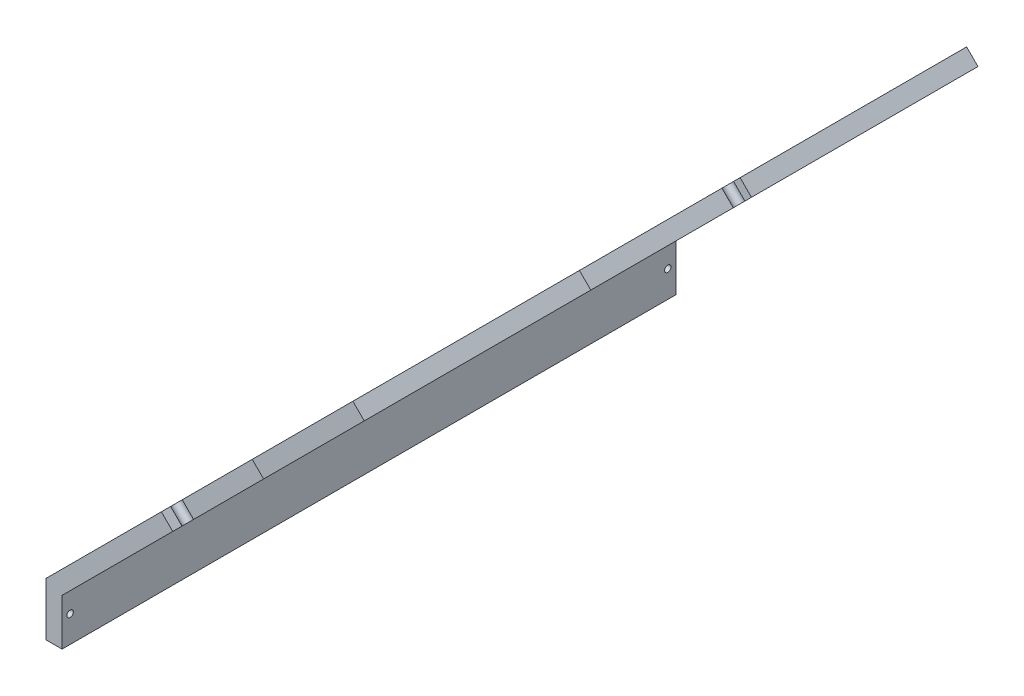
ISO-10303-21;
HEADER;
FILE_DESCRIPTION(('STEP AP214'),'2;1');
FILE_NAME('part.step','',(''),(''),'','','');
FILE_SCHEMA(('AUTOMOTIVE_DESIGN { 1 0 10303 214 1 1 1 1 }'));
ENDSEC;
DATA;
#1=APPLICATION_CONTEXT('core data for automotive mechanical design processes');
#2=APPLICATION_PROTOCOL_DEFINITION('international standard','automotive_design',2000,#1);
#3=PRODUCT_CONTEXT('',#1,'mechanical');
#4=PRODUCT('Part','Part','',(#3));
#5=PRODUCT_RELATED_PRODUCT_CATEGORY('part','',(#4));
#6=PRODUCT_DEFINITION_FORMATION('','',#4);
#7=PRODUCT_DEFINITION_CONTEXT('part definition',#1,'design');
#8=PRODUCT_DEFINITION('design','',#6,#7);
#9=PRODUCT_DEFINITION_SHAPE('','',#8);
#10=(LENGTH_UNIT() NAMED_UNIT(*) SI_UNIT(.MILLI.,.METRE.));
#11=(NAMED_UNIT(*) PLANE_ANGLE_UNIT() SI_UNIT($,.RADIAN.));
#12=(NAMED_UNIT(*) SI_UNIT($,.STERADIAN.) SOLID_ANGLE_UNIT());
#13=UNCERTAINTY_MEASURE_WITH_UNIT(LENGTH_MEASURE(1.E-05),#10,'distance_accuracy_value','');
#14=(GEOMETRIC_REPRESENTATION_CONTEXT(3) GLOBAL_UNCERTAINTY_ASSIGNED_CONTEXT((#13)) GLOBAL_UNIT_ASSIGNED_CONTEXT((#10,
#11,#12)) REPRESENTATION_CONTEXT('',''));
#15=CARTESIAN_POINT('',(0.,0.,0.));
#16=DIRECTION('',(0.,0.,1.));
#17=DIRECTION('',(1.,0.,0.));
#18=AXIS2_PLACEMENT_3D('',#15,#16,#17);
#19=CARTESIAN_POINT('',(0.,0.,191.));
#20=DIRECTION('',(0.,0.,-1.));
#21=DIRECTION('',(-1.,0.,0.));
#22=AXIS2_PLACEMENT_3D('',#19,#20,#21);
#23=PLANE('',#22);
#24=DIRECTION('',(0.707106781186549,0.707106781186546,0.));
#25=VECTOR('',#24,1.);
#26=CARTESIAN_POINT('',(94.0381308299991,108.538130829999,191.));
#27=LINE('',#26,#25);
#28=CARTESIAN_POINT('',(0.,14.5,191.));
#29=VERTEX_POINT('',#28);
#30=CARTESIAN_POINT('',(34.4314575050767,48.9314575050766,191.));
#31=VERTEX_POINT('',#30);
#32=EDGE_CURVE('E336',#29,#31,#27,.T.);
#33=ORIENTED_EDGE('',*,*,#32,.T.);
#34=DIRECTION('',(-0.707106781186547,0.707106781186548,0.));
#35=VECTOR('',#34,1.);
#36=CARTESIAN_POINT('',(34.4314575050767,48.9314575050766,191.));
#37=LINE('',#36,#35);
#38=CARTESIAN_POINT('',(30.895923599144,52.4669914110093,191.));
#39=VERTEX_POINT('',#38);
#40=EDGE_CURVE('E240',#31,#39,#37,.T.);
#41=ORIENTED_EDGE('',*,*,#40,.T.);
#42=DIRECTION('',(-0.707106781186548,-0.707106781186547,0.));
#43=VECTOR('',#42,1.);
#44=CARTESIAN_POINT('',(-5.,16.5710678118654,191.));
#45=LINE('',#44,#43);
#46=CARTESIAN_POINT('',(-5.,16.5710678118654,191.));
#47=VERTEX_POINT('',#46);
#48=EDGE_CURVE('E341',#39,#47,#45,.T.);
#49=ORIENTED_EDGE('',*,*,#48,.T.);
#50=DIRECTION('',(0.,-1.,0.));
#51=VECTOR('',#50,1.);
#52=CARTESIAN_POINT('',(-5.,0.,191.));
#53=LINE('',#52,#51);
#54=CARTESIAN_POINT('',(-5.,0.,191.));
#55=VERTEX_POINT('',#54);
#56=EDGE_CURVE('E345',#47,#55,#53,.T.);
#57=ORIENTED_EDGE('',*,*,#56,.T.);
#58=DIRECTION('',(1.,0.,0.));
#59=VECTOR('',#58,1.);
#60=CARTESIAN_POINT('',(0.,0.,191.));
#61=LINE('',#60,#59);
#62=CARTESIAN_POINT('',(0.,0.,191.));
#63=VERTEX_POINT('',#62);
#64=EDGE_CURVE('E347',#55,#63,#61,.T.);
#65=ORIENTED_EDGE('',*,*,#64,.T.);
#66=DIRECTION('',(0.,1.,0.));
#67=VECTOR('',#66,1.);
#68=CARTESIAN_POINT('',(0.,14.5,191.));
#69=LINE('',#68,#67);
#70=EDGE_CURVE('E332',#63,#29,#69,.T.);
#71=ORIENTED_EDGE('',*,*,#70,.T.);
#72=EDGE_LOOP('',(#33,#41,#49,#57,#65,#71));
#73=FACE_BOUND('',#72,.T.);
#74=ADVANCED_FACE('F33',(#73),#23,.F.);
#75=CARTESIAN_POINT('',(90.5025969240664,112.073664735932,191.));
#76=DIRECTION('',(-0.707106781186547,-0.707106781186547,0.));
#77=DIRECTION('',(0.707106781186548,-0.707106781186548,0.));
#78=AXIS2_PLACEMENT_3D('',#75,#76,#77);
#79=PLANE('',#78);
#80=DIRECTION('',(0.,0.,-1.));
#81=VECTOR('',#80,1.);
#82=CARTESIAN_POINT('',(94.0381308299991,108.538130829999,191.));
#83=LINE('',#82,#81);
#84=CARTESIAN_POINT('',(94.0381308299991,108.538130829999,191.));
#85=VERTEX_POINT('',#84);
#86=CARTESIAN_POINT('',(94.0381308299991,108.538130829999,120.5));
#87=VERTEX_POINT('',#86);
#88=EDGE_CURVE('E41',#85,#87,#83,.T.);
#89=ORIENTED_EDGE('',*,*,#88,.T.);
#90=DIRECTION('',(-0.707106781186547,0.707106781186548,0.));
#91=VECTOR('',#90,1.);
#92=CARTESIAN_POINT('',(94.0381308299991,108.538130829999,120.5));
#93=LINE('',#92,#91);
#94=CARTESIAN_POINT('',(90.5025969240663,112.073664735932,120.5));
#95=VERTEX_POINT('',#94);
#96=EDGE_CURVE('E266',#87,#95,#93,.T.);
#97=ORIENTED_EDGE('',*,*,#96,.T.);
#98=DIRECTION('',(0.,0.,-1.));
#99=VECTOR('',#98,1.);
#100=CARTESIAN_POINT('',(90.5025969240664,112.073664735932,191.));
#101=LINE('',#100,#99);
#102=CARTESIAN_POINT('',(90.5025969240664,112.073664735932,191.));
#103=VERTEX_POINT('',#102);
#104=EDGE_CURVE('E375',#103,#95,#101,.T.);
#105=ORIENTED_EDGE('',*,*,#104,.F.);
#106=DIRECTION('',(-0.707106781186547,0.707106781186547,0.));
#107=VECTOR('',#106,1.);
#108=CARTESIAN_POINT('',(90.5025969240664,112.073664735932,191.));
#109=LINE('',#108,#107);
#110=EDGE_CURVE('E339',#85,#103,#109,.T.);
#111=ORIENTED_EDGE('',*,*,#110,.F.);
#112=EDGE_LOOP('',(#89,#97,#105,#111));
#113=FACE_BOUND('',#112,.T.);
#114=ADVANCED_FACE('F415',(#113),#79,.F.);
#115=CARTESIAN_POINT('',(0.,0.,0.));
#116=DIRECTION('',(0.,0.,-1.));
#117=DIRECTION('',(-1.,0.,0.));
#118=AXIS2_PLACEMENT_3D('',#115,#116,#117);
#119=PLANE('',#118);
#120=DIRECTION('',(-0.707106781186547,0.707106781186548,0.));
#121=VECTOR('',#120,1.);
#122=CARTESIAN_POINT('',(62.7157287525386,77.2157287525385,0.));
#123=LINE('',#122,#121);
#124=CARTESIAN_POINT('',(62.7157287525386,77.2157287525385,0.));
#125=VERTEX_POINT('',#124);
#126=CARTESIAN_POINT('',(59.1801948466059,80.7512626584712,0.));
#127=VERTEX_POINT('',#126);
#128=EDGE_CURVE('E319',#125,#127,#123,.T.);
#129=ORIENTED_EDGE('',*,*,#128,.T.);
#130=DIRECTION('',(-0.707106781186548,-0.707106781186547,0.));
#131=VECTOR('',#130,1.);
#132=CARTESIAN_POINT('',(-5.,16.5710678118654,0.));
#133=LINE('',#132,#131);
#134=CARTESIAN_POINT('',(90.5025969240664,112.073664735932,0.));
#135=VERTEX_POINT('',#134);
#136=EDGE_CURVE('E360',#135,#127,#133,.T.);
#137=ORIENTED_EDGE('',*,*,#136,.F.);
#138=DIRECTION('',(-0.707106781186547,0.707106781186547,0.));
#139=VECTOR('',#138,1.);
#140=CARTESIAN_POINT('',(90.5025969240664,112.073664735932,0.));
#141=LINE('',#140,#139);
#142=CARTESIAN_POINT('',(94.0381308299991,108.538130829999,0.));
#143=VERTEX_POINT('',#142);
#144=EDGE_CURVE('E356',#143,#135,#141,.T.);
#145=ORIENTED_EDGE('',*,*,#144,.F.);
#146=DIRECTION('',(0.707106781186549,0.707106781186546,0.));
#147=VECTOR('',#146,1.);
#148=CARTESIAN_POINT('',(94.0381308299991,108.538130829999,0.));
#149=LINE('',#148,#147);
#150=EDGE_CURVE('E352',#125,#143,#149,.T.);
#151=ORIENTED_EDGE('',*,*,#150,.F.);
#152=EDGE_LOOP('',(#129,#137,#145,#151));
#153=FACE_BOUND('',#152,.T.);
#154=ADVANCED_FACE('F391',(#153),#119,.T.);
#155=CARTESIAN_POINT('',(0.,14.5,191.));
#156=DIRECTION('',(-1.,0.,0.));
#157=DIRECTION('',(0.,-1.,0.));
#158=AXIS2_PLACEMENT_3D('',#155,#156,#157);
#159=PLANE('',#158);
#160=CARTESIAN_POINT('',(0.,8.28553390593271,188.5));
#161=DIRECTION('',(-1.,0.,0.));
#162=DIRECTION('',(0.,-1.,0.));
#163=AXIS2_PLACEMENT_3D('',#160,#161,#162);
#164=CIRCLE('',#163,0.999999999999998);
#165=CARTESIAN_POINT('',(0.,7.28553390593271,188.5));
#166=VERTEX_POINT('',#165);
#167=EDGE_CURVE('E556',#166,#166,#164,.T.);
#168=ORIENTED_EDGE('',*,*,#167,.T.);
#169=EDGE_LOOP('',(#168));
#170=FACE_BOUND('',#169,.T.);
#171=CARTESIAN_POINT('',(0.,8.28553390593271,2.5));
#172=DIRECTION('',(-1.,0.,0.));
#173=DIRECTION('',(0.,-1.,0.));
#174=AXIS2_PLACEMENT_3D('',#171,#172,#173);
#175=CIRCLE('',#174,1.);
#176=CARTESIAN_POINT('',(0.,7.2855339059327,2.5));
#177=VERTEX_POINT('',#176);
#178=EDGE_CURVE('E549',#177,#177,#175,.T.);
#179=ORIENTED_EDGE('',*,*,#178,.T.);
#180=EDGE_LOOP('',(#179));
#181=FACE_BOUND('',#180,.T.);
#182=DIRECTION('',(0.,1.,0.));
#183=VECTOR('',#182,1.);
#184=CARTESIAN_POINT('',(0.,14.5,0.));
#185=LINE('',#184,#183);
#186=CARTESIAN_POINT('',(0.,0.,0.));
#187=VERTEX_POINT('',#186);
#188=CARTESIAN_POINT('',(0.,14.5,0.));
#189=VERTEX_POINT('',#188);
#190=EDGE_CURVE('E322',#187,#189,#185,.T.);
#191=ORIENTED_EDGE('',*,*,#190,.T.);
#192=DIRECTION('',(0.,0.,-1.));
#193=VECTOR('',#192,1.);
#194=CARTESIAN_POINT('',(0.,14.5,191.));
#195=LINE('',#194,#193);
#196=EDGE_CURVE('E11',#29,#189,#195,.T.);
#197=ORIENTED_EDGE('',*,*,#196,.F.);
#198=ORIENTED_EDGE('',*,*,#70,.F.);
#199=DIRECTION('',(0.,0.,-1.));
#200=VECTOR('',#199,1.);
#201=CARTESIAN_POINT('',(0.,0.,191.));
#202=LINE('',#201,#200);
#203=EDGE_CURVE('E349',#63,#187,#202,.T.);
#204=ORIENTED_EDGE('',*,*,#203,.T.);
#205=EDGE_LOOP('',(#191,#197,#198,#204));
#206=FACE_BOUND('',#205,.T.);
#207=ADVANCED_FACE('F35',(#170,#181,#206),#159,.F.);
#208=CARTESIAN_POINT('',(94.0381308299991,108.538130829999,191.));
#209=DIRECTION('',(-0.707106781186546,0.707106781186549,0.));
#210=DIRECTION('',(-0.707106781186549,-0.707106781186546,0.));
#211=AXIS2_PLACEMENT_3D('',#208,#209,#210);
#212=PLANE('',#211);
#213=CARTESIAN_POINT('',(16.4834957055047,30.9834957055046,2.50000000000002));
#214=DIRECTION('',(-0.707106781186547,0.707106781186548,0.));
#215=DIRECTION('',(-0.707106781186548,-0.707106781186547,0.));
#216=AXIS2_PLACEMENT_3D('',#213,#214,#215);
#217=CIRCLE('',#216,1.);
#218=CARTESIAN_POINT('',(15.7763889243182,30.2763889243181,2.50000000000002));
#219=VERTEX_POINT('',#218);
#220=EDGE_CURVE('E508',#219,#219,#217,.T.);
#221=ORIENTED_EDGE('',*,*,#220,.T.);
#222=EDGE_LOOP('',(#221));
#223=FACE_BOUND('',#222,.T.);
#224=CARTESIAN_POINT('',(16.4834957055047,30.9834957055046,188.5));
#225=DIRECTION('',(-0.707106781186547,0.707106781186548,0.));
#226=DIRECTION('',(-0.707106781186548,-0.707106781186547,0.));
#227=AXIS2_PLACEMENT_3D('',#224,#225,#226);
#228=CIRCLE('',#227,0.999999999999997);
#229=CARTESIAN_POINT('',(15.7763889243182,30.2763889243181,188.5));
#230=VERTEX_POINT('',#229);
#231=EDGE_CURVE('E512',#230,#230,#228,.T.);
#232=ORIENTED_EDGE('',*,*,#231,.T.);
#233=EDGE_LOOP('',(#232));
#234=FACE_BOUND('',#233,.T.);
#235=CARTESIAN_POINT('',(78.3769297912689,92.8769297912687,188.5));
#236=DIRECTION('',(-0.707106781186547,0.707106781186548,0.));
#237=DIRECTION('',(-0.707106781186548,-0.707106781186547,0.));
#238=AXIS2_PLACEMENT_3D('',#235,#236,#237);
#239=CIRCLE('',#238,0.999999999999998);
#240=CARTESIAN_POINT('',(77.6698230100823,92.1698230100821,188.5));
#241=VERTEX_POINT('',#240);
#242=EDGE_CURVE('E516',#241,#241,#239,.T.);
#243=ORIENTED_EDGE('',*,*,#242,.T.);
#244=EDGE_LOOP('',(#243));
#245=FACE_BOUND('',#244,.T.);
#246=CARTESIAN_POINT('',(92.2690654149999,106.769065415,155.75));
#247=DIRECTION('',(-0.707106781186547,0.707106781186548,0.));
#248=DIRECTION('',(-0.707106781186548,-0.707106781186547,0.));
#249=AXIS2_PLACEMENT_3D('',#246,#247,#248);
#250=CIRCLE('',#249,0.999999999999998);
#251=CARTESIAN_POINT('',(91.5619586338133,106.061958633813,155.75));
#252=VERTEX_POINT('',#251);
#253=EDGE_CURVE('E520',#252,#252,#250,.T.);
#254=ORIENTED_EDGE('',*,*,#253,.T.);
#255=EDGE_LOOP('',(#254));
#256=FACE_BOUND('',#255,.T.);
#257=CARTESIAN_POINT('',(78.3769297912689,92.8769297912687,2.49999999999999));
#258=DIRECTION('',(-0.707106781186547,0.707106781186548,0.));
#259=DIRECTION('',(-0.707106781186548,-0.707106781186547,0.));
#260=AXIS2_PLACEMENT_3D('',#257,#258,#259);
#261=CIRCLE('',#260,1.);
#262=CARTESIAN_POINT('',(77.6698230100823,92.1698230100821,2.49999999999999));
#263=VERTEX_POINT('',#262);
#264=EDGE_CURVE('E524',#263,#263,#261,.T.);
#265=ORIENTED_EDGE('',*,*,#264,.T.);
#266=EDGE_LOOP('',(#265));
#267=FACE_BOUND('',#266,.T.);
#268=CARTESIAN_POINT('',(92.173445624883,106.673445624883,35.1196842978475));
#269=DIRECTION('',(-0.707106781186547,0.707106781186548,0.));
#270=DIRECTION('',(-0.707106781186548,-0.707106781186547,0.));
#271=AXIS2_PLACEMENT_3D('',#268,#269,#270);
#272=CIRCLE('',#271,1.);
#273=CARTESIAN_POINT('',(91.4663388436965,105.966338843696,35.1196842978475));
#274=VERTEX_POINT('',#273);
#275=EDGE_CURVE('E233',#274,#274,#272,.T.);
#276=ORIENTED_EDGE('',*,*,#275,.T.);
#277=EDGE_LOOP('',(#276));
#278=FACE_BOUND('',#277,.T.);
#279=CARTESIAN_POINT('',(35.1814575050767,49.6814575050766,187.06066017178));
#280=DIRECTION('',(-0.707106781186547,0.707106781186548,0.));
#281=DIRECTION('',(-0.707106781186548,-0.707106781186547,0.));
#282=AXIS2_PLACEMENT_3D('',#279,#280,#281);
#283=CIRCLE('',#282,1.49999999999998);
#284=CARTESIAN_POINT('',(35.9314575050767,50.4314575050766,186.));
#285=VERTEX_POINT('',#284);
#286=CARTESIAN_POINT('',(34.4314575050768,48.9314575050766,188.12132034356));
#287=VERTEX_POINT('',#286);
#288=EDGE_CURVE('E226',#285,#287,#283,.T.);
#289=ORIENTED_EDGE('',*,*,#288,.T.);
#290=DIRECTION('',(0.,0.,1.));
#291=VECTOR('',#290,1.);
#292=CARTESIAN_POINT('',(34.4314575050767,48.9314575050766,191.));
#293=LINE('',#292,#291);
#294=EDGE_CURVE('E228',#287,#31,#293,.T.);
#295=ORIENTED_EDGE('',*,*,#294,.T.);
#296=ORIENTED_EDGE('',*,*,#32,.F.);
#297=ORIENTED_EDGE('',*,*,#196,.T.);
#298=CARTESIAN_POINT('',(34.4314575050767,48.9314575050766,0.));
#299=VERTEX_POINT('',#298);
#300=EDGE_CURVE('E353',#189,#299,#149,.T.);
#301=ORIENTED_EDGE('',*,*,#300,.T.);
#302=DIRECTION('',(0.,0.,1.));
#303=VECTOR('',#302,1.);
#304=CARTESIAN_POINT('',(34.4314575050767,48.9314575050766,2.87867965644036));
#305=LINE('',#304,#303);
#306=CARTESIAN_POINT('',(34.4314575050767,48.9314575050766,2.87867965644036));
#307=VERTEX_POINT('',#306);
#308=EDGE_CURVE('E290',#299,#307,#305,.T.);
#309=ORIENTED_EDGE('',*,*,#308,.T.);
#310=CARTESIAN_POINT('',(35.1814575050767,49.6814575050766,3.93933982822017));
#311=DIRECTION('',(-0.707106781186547,0.707106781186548,0.));
#312=DIRECTION('',(-0.707106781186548,-0.707106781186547,0.));
#313=AXIS2_PLACEMENT_3D('',#310,#311,#312);
#314=CIRCLE('',#313,1.5);
#315=CARTESIAN_POINT('',(35.9314575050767,50.4314575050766,4.99999999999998));
#316=VERTEX_POINT('',#315);
#317=EDGE_CURVE('E293',#307,#316,#314,.T.);
#318=ORIENTED_EDGE('',*,*,#317,.T.);
#319=DIRECTION('',(0.707106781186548,0.707106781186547,0.));
#320=VECTOR('',#319,1.);
#321=CARTESIAN_POINT('',(61.2157287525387,75.7157287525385,5.00000000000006));
#322=LINE('',#321,#320);
#323=CARTESIAN_POINT('',(61.2157287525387,75.7157287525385,5.00000000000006));
#324=VERTEX_POINT('',#323);
#325=EDGE_CURVE('E297',#316,#324,#322,.T.);
#326=ORIENTED_EDGE('',*,*,#325,.T.);
#327=CARTESIAN_POINT('',(61.9657287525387,76.4657287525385,3.93933982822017));
#328=DIRECTION('',(-0.707106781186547,0.707106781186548,0.));
#329=DIRECTION('',(-0.707106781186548,-0.707106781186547,0.));
#330=AXIS2_PLACEMENT_3D('',#327,#328,#329);
#331=CIRCLE('',#330,1.49999999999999);
#332=CARTESIAN_POINT('',(62.7157287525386,77.2157287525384,2.87867965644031));
#333=VERTEX_POINT('',#332);
#334=EDGE_CURVE('E300',#324,#333,#331,.T.);
#335=ORIENTED_EDGE('',*,*,#334,.T.);
#336=DIRECTION('',(0.,0.,-1.));
#337=VECTOR('',#336,1.);
#338=CARTESIAN_POINT('',(62.7157287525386,77.2157287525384,2.87867965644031));
#339=LINE('',#338,#337);
#340=EDGE_CURVE('E303',#333,#125,#339,.T.);
#341=ORIENTED_EDGE('',*,*,#340,.T.);
#342=ORIENTED_EDGE('',*,*,#150,.T.);
#343=CARTESIAN_POINT('',(94.0381308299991,108.538130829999,70.5));
#344=VERTEX_POINT('',#343);
#345=EDGE_CURVE('E377',#344,#143,#83,.T.);
#346=ORIENTED_EDGE('',*,*,#345,.F.);
#347=DIRECTION('',(-0.70710678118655,-0.707106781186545,0.));
#348=VECTOR('',#347,1.);
#349=CARTESIAN_POINT('',(92.0000000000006,106.5,70.5));
#350=LINE('',#349,#348);
#351=CARTESIAN_POINT('',(92.0000000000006,106.5,70.5));
#352=VERTEX_POINT('',#351);
#353=EDGE_CURVE('E253',#344,#352,#350,.T.);
#354=ORIENTED_EDGE('',*,*,#353,.T.);
#355=CARTESIAN_POINT('',(91.2500000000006,105.75,71.5606601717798));
#356=DIRECTION('',(-0.707106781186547,0.707106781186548,0.));
#357=DIRECTION('',(-0.707106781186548,-0.707106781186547,0.));
#358=AXIS2_PLACEMENT_3D('',#355,#356,#357);
#359=CIRCLE('',#358,1.49999999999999);
#360=CARTESIAN_POINT('',(90.5000000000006,105.,72.6213203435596));
#361=VERTEX_POINT('',#360);
#362=EDGE_CURVE('E257',#352,#361,#359,.T.);
#363=ORIENTED_EDGE('',*,*,#362,.T.);
#364=DIRECTION('',(0.,0.,1.));
#365=VECTOR('',#364,1.);
#366=CARTESIAN_POINT('',(90.5000000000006,105.,72.6213203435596));
#367=LINE('',#366,#365);
#368=CARTESIAN_POINT('',(90.5000000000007,105.,118.37867965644));
#369=VERTEX_POINT('',#368);
#370=EDGE_CURVE('E260',#361,#369,#367,.T.);
#371=ORIENTED_EDGE('',*,*,#370,.T.);
#372=CARTESIAN_POINT('',(91.2500000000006,105.75,119.43933982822));
#373=DIRECTION('',(-0.707106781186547,0.707106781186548,0.));
#374=DIRECTION('',(-0.707106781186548,-0.707106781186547,0.));
#375=AXIS2_PLACEMENT_3D('',#372,#373,#374);
#376=CIRCLE('',#375,1.49999999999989);
#377=CARTESIAN_POINT('',(92.0000000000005,106.5,120.5));
#378=VERTEX_POINT('',#377);
#379=EDGE_CURVE('E263',#369,#378,#376,.T.);
#380=ORIENTED_EDGE('',*,*,#379,.T.);
#381=DIRECTION('',(0.707106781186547,0.707106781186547,0.));
#382=VECTOR('',#381,1.);
#383=CARTESIAN_POINT('',(92.0000000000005,106.5,120.5));
#384=LINE('',#383,#382);
#385=EDGE_CURVE('E250',#378,#87,#384,.T.);
#386=ORIENTED_EDGE('',*,*,#385,.T.);
#387=ORIENTED_EDGE('',*,*,#88,.F.);
#388=CARTESIAN_POINT('',(62.7157287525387,77.2157287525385,191.));
#389=VERTEX_POINT('',#388);
#390=EDGE_CURVE('E216',#389,#85,#27,.T.);
#391=ORIENTED_EDGE('',*,*,#390,.F.);
#392=DIRECTION('',(0.,0.,-1.));
#393=VECTOR('',#392,1.);
#394=CARTESIAN_POINT('',(62.7157287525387,77.2157287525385,191.));
#395=LINE('',#394,#393);
#396=CARTESIAN_POINT('',(62.7157287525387,77.2157287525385,188.12132034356));
#397=VERTEX_POINT('',#396);
#398=EDGE_CURVE('E48',#389,#397,#395,.T.);
#399=ORIENTED_EDGE('',*,*,#398,.T.);
#400=CARTESIAN_POINT('',(61.9657287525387,76.4657287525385,187.06066017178));
#401=DIRECTION('',(-0.707106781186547,0.707106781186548,0.));
#402=DIRECTION('',(-0.707106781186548,-0.707106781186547,0.));
#403=AXIS2_PLACEMENT_3D('',#400,#401,#402);
#404=CIRCLE('',#403,1.5);
#405=CARTESIAN_POINT('',(61.2157287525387,75.7157287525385,186.));
#406=VERTEX_POINT('',#405);
#407=EDGE_CURVE('E205',#397,#406,#404,.T.);
#408=ORIENTED_EDGE('',*,*,#407,.T.);
#409=DIRECTION('',(-0.707106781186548,-0.707106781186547,0.));
#410=VECTOR('',#409,1.);
#411=CARTESIAN_POINT('',(61.2157287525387,75.7157287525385,186.));
#412=LINE('',#411,#410);
#413=EDGE_CURVE('E210',#406,#285,#412,.T.);
#414=ORIENTED_EDGE('',*,*,#413,.T.);
#415=EDGE_LOOP('',(#289,#295,#296,#297,#301,#309,#318,#326,#335,#341,#342,#346,#354,#363,#371,
#380,#386,#387,#391,#399,#408,#414));
#416=FACE_BOUND('',#415,.T.);
#417=ADVANCED_FACE('F214',(#223,#234,#245,#256,#267,#278,#416),#212,.F.);
#418=CARTESIAN_POINT('',(90.5025969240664,112.073664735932,70.5));
#419=VERTEX_POINT('',#418);
#420=EDGE_CURVE('E374',#419,#135,#101,.T.);
#421=ORIENTED_EDGE('',*,*,#420,.F.);
#422=DIRECTION('',(-0.707106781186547,0.707106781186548,0.));
#423=VECTOR('',#422,1.);
#424=CARTESIAN_POINT('',(94.0381308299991,108.538130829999,70.5));
#425=LINE('',#424,#423);
#426=EDGE_CURVE('E56',#344,#419,#425,.T.);
#427=ORIENTED_EDGE('',*,*,#426,.F.);
#428=ORIENTED_EDGE('',*,*,#345,.T.);
#429=ORIENTED_EDGE('',*,*,#144,.T.);
#430=EDGE_LOOP('',(#421,#427,#428,#429));
#431=FACE_BOUND('',#430,.T.);
#432=ADVANCED_FACE('F385',(#431),#79,.F.);
#433=CARTESIAN_POINT('',(-5.,16.5710678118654,191.));
#434=DIRECTION('',(0.707106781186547,-0.707106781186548,0.));
#435=DIRECTION('',(0.707106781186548,0.707106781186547,0.));
#436=AXIS2_PLACEMENT_3D('',#433,#434,#435);
#437=PLANE('',#436);
#438=CARTESIAN_POINT('',(12.947961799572,34.5190296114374,2.50000000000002));
#439=DIRECTION('',(-0.707106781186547,0.707106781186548,0.));
#440=DIRECTION('',(-0.707106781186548,-0.707106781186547,0.));
#441=AXIS2_PLACEMENT_3D('',#438,#439,#440);
#442=CIRCLE('',#441,1.);
#443=CARTESIAN_POINT('',(12.2408550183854,33.8119228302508,2.50000000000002));
#444=VERTEX_POINT('',#443);
#445=EDGE_CURVE('E546',#444,#444,#442,.T.);
#446=ORIENTED_EDGE('',*,*,#445,.F.);
#447=EDGE_LOOP('',(#446));
#448=FACE_BOUND('',#447,.T.);
#449=CARTESIAN_POINT('',(12.947961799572,34.5190296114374,188.5));
#450=DIRECTION('',(-0.707106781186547,0.707106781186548,0.));
#451=DIRECTION('',(-0.707106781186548,-0.707106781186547,0.));
#452=AXIS2_PLACEMENT_3D('',#449,#450,#451);
#453=CIRCLE('',#452,0.999999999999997);
#454=CARTESIAN_POINT('',(12.2408550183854,33.8119228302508,188.5));
#455=VERTEX_POINT('',#454);
#456=EDGE_CURVE('E542',#455,#455,#453,.T.);
#457=ORIENTED_EDGE('',*,*,#456,.F.);
#458=EDGE_LOOP('',(#457));
#459=FACE_BOUND('',#458,.T.);
#460=CARTESIAN_POINT('',(74.8413958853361,96.4124636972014,188.5));
#461=DIRECTION('',(-0.707106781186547,0.707106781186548,0.));
#462=DIRECTION('',(-0.707106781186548,-0.707106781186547,0.));
#463=AXIS2_PLACEMENT_3D('',#460,#461,#462);
#464=CIRCLE('',#463,0.999999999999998);
#465=CARTESIAN_POINT('',(74.1342891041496,95.7053569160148,188.5));
#466=VERTEX_POINT('',#465);
#467=EDGE_CURVE('E538',#466,#466,#464,.T.);
#468=ORIENTED_EDGE('',*,*,#467,.F.);
#469=EDGE_LOOP('',(#468));
#470=FACE_BOUND('',#469,.T.);
#471=CARTESIAN_POINT('',(88.7335315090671,110.304599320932,155.75));
#472=DIRECTION('',(-0.707106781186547,0.707106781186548,0.));
#473=DIRECTION('',(-0.707106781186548,-0.707106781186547,0.));
#474=AXIS2_PLACEMENT_3D('',#471,#472,#473);
#475=CIRCLE('',#474,0.999999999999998);
#476=CARTESIAN_POINT('',(88.0264247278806,109.597492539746,155.75));
#477=VERTEX_POINT('',#476);
#478=EDGE_CURVE('E534',#477,#477,#475,.T.);
#479=ORIENTED_EDGE('',*,*,#478,.F.);
#480=EDGE_LOOP('',(#479));
#481=FACE_BOUND('',#480,.T.);
#482=CARTESIAN_POINT('',(74.8413958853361,96.4124636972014,2.49999999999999));
#483=DIRECTION('',(-0.707106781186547,0.707106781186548,0.));
#484=DIRECTION('',(-0.707106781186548,-0.707106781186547,0.));
#485=AXIS2_PLACEMENT_3D('',#482,#483,#484);
#486=CIRCLE('',#485,1.);
#487=CARTESIAN_POINT('',(74.1342891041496,95.7053569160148,2.49999999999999));
#488=VERTEX_POINT('',#487);
#489=EDGE_CURVE('E530',#488,#488,#486,.T.);
#490=ORIENTED_EDGE('',*,*,#489,.F.);
#491=EDGE_LOOP('',(#490));
#492=FACE_BOUND('',#491,.T.);
#493=CARTESIAN_POINT('',(88.6379117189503,110.208979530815,35.1196842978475));
#494=DIRECTION('',(-0.707106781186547,0.707106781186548,0.));
#495=DIRECTION('',(-0.707106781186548,-0.707106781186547,0.));
#496=AXIS2_PLACEMENT_3D('',#493,#494,#495);
#497=CIRCLE('',#496,1.);
#498=CARTESIAN_POINT('',(87.9308049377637,109.501872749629,35.1196842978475));
#499=VERTEX_POINT('',#498);
#500=EDGE_CURVE('E222',#499,#499,#497,.T.);
#501=ORIENTED_EDGE('',*,*,#500,.F.);
#502=EDGE_LOOP('',(#501));
#503=FACE_BOUND('',#502,.T.);
#504=ORIENTED_EDGE('',*,*,#48,.F.);
#505=DIRECTION('',(0.,0.,1.));
#506=VECTOR('',#505,1.);
#507=CARTESIAN_POINT('',(30.895923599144,52.4669914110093,191.));
#508=LINE('',#507,#506);
#509=CARTESIAN_POINT('',(30.895923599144,52.4669914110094,188.12132034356));
#510=VERTEX_POINT('',#509);
#511=EDGE_CURVE('E217',#510,#39,#508,.T.);
#512=ORIENTED_EDGE('',*,*,#511,.F.);
#513=CARTESIAN_POINT('',(31.645923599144,53.2169914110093,187.06066017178));
#514=DIRECTION('',(-0.707106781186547,0.707106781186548,0.));
#515=DIRECTION('',(-0.707106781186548,-0.707106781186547,0.));
#516=AXIS2_PLACEMENT_3D('',#513,#514,#515);
#517=CIRCLE('',#516,1.49999999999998);
#518=CARTESIAN_POINT('',(32.395923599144,53.9669914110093,186.));
#519=VERTEX_POINT('',#518);
#520=EDGE_CURVE('E219',#519,#510,#517,.T.);
#521=ORIENTED_EDGE('',*,*,#520,.F.);
#522=DIRECTION('',(-0.707106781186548,-0.707106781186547,0.));
#523=VECTOR('',#522,1.);
#524=CARTESIAN_POINT('',(57.6801948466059,79.2512626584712,186.));
#525=LINE('',#524,#523);
#526=CARTESIAN_POINT('',(57.6801948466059,79.2512626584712,186.));
#527=VERTEX_POINT('',#526);
#528=EDGE_CURVE('E235',#527,#519,#525,.T.);
#529=ORIENTED_EDGE('',*,*,#528,.F.);
#530=CARTESIAN_POINT('',(58.4301948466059,80.0012626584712,187.06066017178));
#531=DIRECTION('',(-0.707106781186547,0.707106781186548,0.));
#532=DIRECTION('',(-0.707106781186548,-0.707106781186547,0.));
#533=AXIS2_PLACEMENT_3D('',#530,#531,#532);
#534=CIRCLE('',#533,1.5);
#535=CARTESIAN_POINT('',(59.1801948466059,80.7512626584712,188.12132034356));
#536=VERTEX_POINT('',#535);
#537=EDGE_CURVE('E232',#536,#527,#534,.T.);
#538=ORIENTED_EDGE('',*,*,#537,.F.);
#539=DIRECTION('',(0.,0.,-1.));
#540=VECTOR('',#539,1.);
#541=CARTESIAN_POINT('',(59.1801948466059,80.7512626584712,191.));
#542=LINE('',#541,#540);
#543=CARTESIAN_POINT('',(59.1801948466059,80.7512626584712,191.));
#544=VERTEX_POINT('',#543);
#545=EDGE_CURVE('E197',#544,#536,#542,.T.);
#546=ORIENTED_EDGE('',*,*,#545,.F.);
#547=EDGE_CURVE('E342',#103,#544,#45,.T.);
#548=ORIENTED_EDGE('',*,*,#547,.F.);
#549=ORIENTED_EDGE('',*,*,#104,.T.);
#550=DIRECTION('',(0.707106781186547,0.707106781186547,0.));
#551=VECTOR('',#550,1.);
#552=CARTESIAN_POINT('',(88.4644660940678,110.035533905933,120.5));
#553=LINE('',#552,#551);
#554=CARTESIAN_POINT('',(88.4644660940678,110.035533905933,120.5));
#555=VERTEX_POINT('',#554);
#556=EDGE_CURVE('E243',#555,#95,#553,.T.);
#557=ORIENTED_EDGE('',*,*,#556,.F.);
#558=CARTESIAN_POINT('',(87.7144660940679,109.285533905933,119.43933982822));
#559=DIRECTION('',(-0.707106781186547,0.707106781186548,0.));
#560=DIRECTION('',(-0.707106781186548,-0.707106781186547,0.));
#561=AXIS2_PLACEMENT_3D('',#558,#559,#560);
#562=CIRCLE('',#561,1.49999999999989);
#563=CARTESIAN_POINT('',(86.9644660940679,108.535533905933,118.37867965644));
#564=VERTEX_POINT('',#563);
#565=EDGE_CURVE('E254',#564,#555,#562,.T.);
#566=ORIENTED_EDGE('',*,*,#565,.F.);
#567=DIRECTION('',(0.,0.,1.));
#568=VECTOR('',#567,1.);
#569=CARTESIAN_POINT('',(86.9644660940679,108.535533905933,72.6213203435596));
#570=LINE('',#569,#568);
#571=CARTESIAN_POINT('',(86.9644660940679,108.535533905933,72.6213203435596));
#572=VERTEX_POINT('',#571);
#573=EDGE_CURVE('E273',#572,#564,#570,.T.);
#574=ORIENTED_EDGE('',*,*,#573,.F.);
#575=CARTESIAN_POINT('',(87.7144660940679,109.285533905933,71.5606601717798));
#576=DIRECTION('',(-0.707106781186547,0.707106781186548,0.));
#577=DIRECTION('',(-0.707106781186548,-0.707106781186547,0.));
#578=AXIS2_PLACEMENT_3D('',#575,#576,#577);
#579=CIRCLE('',#578,1.49999999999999);
#580=CARTESIAN_POINT('',(88.4644660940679,110.035533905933,70.5));
#581=VERTEX_POINT('',#580);
#582=EDGE_CURVE('E270',#581,#572,#579,.T.);
#583=ORIENTED_EDGE('',*,*,#582,.F.);
#584=DIRECTION('',(-0.70710678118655,-0.707106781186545,0.));
#585=VECTOR('',#584,1.);
#586=CARTESIAN_POINT('',(88.4644660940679,110.035533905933,70.5));
#587=LINE('',#586,#585);
#588=EDGE_CURVE('E268',#419,#581,#587,.T.);
#589=ORIENTED_EDGE('',*,*,#588,.F.);
#590=ORIENTED_EDGE('',*,*,#420,.T.);
#591=ORIENTED_EDGE('',*,*,#136,.T.);
#592=DIRECTION('',(0.,0.,-1.));
#593=VECTOR('',#592,1.);
#594=CARTESIAN_POINT('',(59.1801948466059,80.7512626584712,2.87867965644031));
#595=LINE('',#594,#593);
#596=CARTESIAN_POINT('',(59.1801948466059,80.7512626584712,2.87867965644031));
#597=VERTEX_POINT('',#596);
#598=EDGE_CURVE('E294',#597,#127,#595,.T.);
#599=ORIENTED_EDGE('',*,*,#598,.F.);
#600=CARTESIAN_POINT('',(58.4301948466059,80.0012626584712,3.93933982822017));
#601=DIRECTION('',(-0.707106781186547,0.707106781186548,0.));
#602=DIRECTION('',(-0.707106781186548,-0.707106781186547,0.));
#603=AXIS2_PLACEMENT_3D('',#600,#601,#602);
#604=CIRCLE('',#603,1.49999999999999);
#605=CARTESIAN_POINT('',(57.680194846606,79.2512626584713,5.00000000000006));
#606=VERTEX_POINT('',#605);
#607=EDGE_CURVE('E315',#606,#597,#604,.T.);
#608=ORIENTED_EDGE('',*,*,#607,.F.);
#609=DIRECTION('',(0.707106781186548,0.707106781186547,0.));
#610=VECTOR('',#609,1.);
#611=CARTESIAN_POINT('',(57.680194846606,79.2512626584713,5.00000000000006));
#612=LINE('',#611,#610);
#613=CARTESIAN_POINT('',(32.395923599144,53.9669914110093,4.99999999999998));
#614=VERTEX_POINT('',#613);
#615=EDGE_CURVE('E312',#614,#606,#612,.T.);
#616=ORIENTED_EDGE('',*,*,#615,.F.);
#617=CARTESIAN_POINT('',(31.645923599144,53.2169914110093,3.93933982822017));
#618=DIRECTION('',(-0.707106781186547,0.707106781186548,0.));
#619=DIRECTION('',(-0.707106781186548,-0.707106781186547,0.));
#620=AXIS2_PLACEMENT_3D('',#617,#618,#619);
#621=CIRCLE('',#620,1.5);
#622=CARTESIAN_POINT('',(30.895923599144,52.4669914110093,2.87867965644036));
#623=VERTEX_POINT('',#622);
#624=EDGE_CURVE('E309',#623,#614,#621,.T.);
#625=ORIENTED_EDGE('',*,*,#624,.F.);
#626=DIRECTION('',(0.,0.,1.));
#627=VECTOR('',#626,1.);
#628=CARTESIAN_POINT('',(30.895923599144,52.4669914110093,2.87867965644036));
#629=LINE('',#628,#627);
#630=CARTESIAN_POINT('',(30.895923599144,52.4669914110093,0.));
#631=VERTEX_POINT('',#630);
#632=EDGE_CURVE('E280',#631,#623,#629,.T.);
#633=ORIENTED_EDGE('',*,*,#632,.F.);
#634=CARTESIAN_POINT('',(-5.,16.5710678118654,0.));
#635=VERTEX_POINT('',#634);
#636=EDGE_CURVE('E359',#631,#635,#133,.T.);
#637=ORIENTED_EDGE('',*,*,#636,.T.);
#638=DIRECTION('',(0.,0.,-1.));
#639=VECTOR('',#638,1.);
#640=CARTESIAN_POINT('',(-5.,16.5710678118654,191.));
#641=LINE('',#640,#639);
#642=EDGE_CURVE('E371',#47,#635,#641,.T.);
#643=ORIENTED_EDGE('',*,*,#642,.F.);
#644=EDGE_LOOP('',(#504,#512,#521,#529,#538,#546,#548,#549,#557,#566,#574,#583,#589,#590,#591,
#599,#608,#616,#625,#633,#637,#643));
#645=FACE_BOUND('',#644,.T.);
#646=ADVANCED_FACE('F395',(#448,#459,#470,#481,#492,#503,#645),#437,.F.);
#647=CARTESIAN_POINT('',(-5.,0.,191.));
#648=DIRECTION('',(1.,0.,0.));
#649=DIRECTION('',(0.,1.,0.));
#650=AXIS2_PLACEMENT_3D('',#647,#648,#649);
#651=PLANE('',#650);
#652=CARTESIAN_POINT('',(-5.,8.28553390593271,188.5));
#653=DIRECTION('',(-1.,0.,0.));
#654=DIRECTION('',(0.,-1.,0.));
#655=AXIS2_PLACEMENT_3D('',#652,#653,#654);
#656=CIRCLE('',#655,0.999999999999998);
#657=CARTESIAN_POINT('',(-5.,7.28553390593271,188.5));
#658=VERTEX_POINT('',#657);
#659=EDGE_CURVE('E559',#658,#658,#656,.T.);
#660=ORIENTED_EDGE('',*,*,#659,.F.);
#661=EDGE_LOOP('',(#660));
#662=FACE_BOUND('',#661,.T.);
#663=CARTESIAN_POINT('',(-5.,8.28553390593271,2.5));
#664=DIRECTION('',(-1.,0.,0.));
#665=DIRECTION('',(0.,-1.,0.));
#666=AXIS2_PLACEMENT_3D('',#663,#664,#665);
#667=CIRCLE('',#666,1.);
#668=CARTESIAN_POINT('',(-5.,7.2855339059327,2.5));
#669=VERTEX_POINT('',#668);
#670=EDGE_CURVE('E553',#669,#669,#667,.T.);
#671=ORIENTED_EDGE('',*,*,#670,.F.);
#672=EDGE_LOOP('',(#671));
#673=FACE_BOUND('',#672,.T.);
#674=DIRECTION('',(0.,-1.,0.));
#675=VECTOR('',#674,1.);
#676=CARTESIAN_POINT('',(-5.,0.,0.));
#677=LINE('',#676,#675);
#678=CARTESIAN_POINT('',(-5.,0.,0.));
#679=VERTEX_POINT('',#678);
#680=EDGE_CURVE('E363',#635,#679,#677,.T.);
#681=ORIENTED_EDGE('',*,*,#680,.T.);
#682=DIRECTION('',(0.,0.,-1.));
#683=VECTOR('',#682,1.);
#684=CARTESIAN_POINT('',(-5.,0.,191.));
#685=LINE('',#684,#683);
#686=EDGE_CURVE('E368',#55,#679,#685,.T.);
#687=ORIENTED_EDGE('',*,*,#686,.F.);
#688=ORIENTED_EDGE('',*,*,#56,.F.);
#689=ORIENTED_EDGE('',*,*,#642,.T.);
#690=EDGE_LOOP('',(#681,#687,#688,#689));
#691=FACE_BOUND('',#690,.T.);
#692=ADVANCED_FACE('F438',(#662,#673,#691),#651,.F.);
#693=CARTESIAN_POINT('',(0.,0.,191.));
#694=DIRECTION('',(0.,1.,0.));
#695=DIRECTION('',(-1.,0.,0.));
#696=AXIS2_PLACEMENT_3D('',#693,#694,#695);
#697=PLANE('',#696);
#698=DIRECTION('',(1.,0.,0.));
#699=VECTOR('',#698,1.);
#700=CARTESIAN_POINT('',(0.,0.,0.));
#701=LINE('',#700,#699);
#702=EDGE_CURVE('E335',#679,#187,#701,.T.);
#703=ORIENTED_EDGE('',*,*,#702,.T.);
#704=ORIENTED_EDGE('',*,*,#203,.F.);
#705=ORIENTED_EDGE('',*,*,#64,.F.);
#706=ORIENTED_EDGE('',*,*,#686,.T.);
#707=EDGE_LOOP('',(#703,#704,#705,#706));
#708=FACE_BOUND('',#707,.T.);
#709=ADVANCED_FACE('F444',(#708),#697,.F.);
#710=ORIENTED_EDGE('',*,*,#547,.T.);
#711=DIRECTION('',(-0.707106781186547,0.707106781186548,0.));
#712=VECTOR('',#711,1.);
#713=CARTESIAN_POINT('',(62.7157287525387,77.2157287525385,191.));
#714=LINE('',#713,#712);
#715=EDGE_CURVE('E202',#389,#544,#714,.T.);
#716=ORIENTED_EDGE('',*,*,#715,.F.);
#717=ORIENTED_EDGE('',*,*,#390,.T.);
#718=ORIENTED_EDGE('',*,*,#110,.T.);
#719=EDGE_LOOP('',(#710,#716,#717,#718));
#720=FACE_BOUND('',#719,.T.);
#721=ADVANCED_FACE('F418',(#720),#23,.F.);
#722=DIRECTION('',(-0.707106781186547,0.707106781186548,0.));
#723=VECTOR('',#722,1.);
#724=CARTESIAN_POINT('',(34.4314575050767,48.9314575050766,0.));
#725=LINE('',#724,#723);
#726=EDGE_CURVE('E306',#299,#631,#725,.T.);
#727=ORIENTED_EDGE('',*,*,#726,.F.);
#728=ORIENTED_EDGE('',*,*,#300,.F.);
#729=ORIENTED_EDGE('',*,*,#190,.F.);
#730=ORIENTED_EDGE('',*,*,#702,.F.);
#731=ORIENTED_EDGE('',*,*,#680,.F.);
#732=ORIENTED_EDGE('',*,*,#636,.F.);
#733=EDGE_LOOP('',(#727,#728,#729,#730,#731,#732));
#734=FACE_BOUND('',#733,.T.);
#735=ADVANCED_FACE('F450',(#734),#119,.T.);
#736=CARTESIAN_POINT('',(62.7157287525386,77.2157287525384,2.87867965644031));
#737=DIRECTION('',(0.707106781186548,0.707106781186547,0.));
#738=DIRECTION('',(-0.707106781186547,0.707106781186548,0.));
#739=AXIS2_PLACEMENT_3D('',#736,#737,#738);
#740=PLANE('',#739);
#741=ORIENTED_EDGE('',*,*,#598,.T.);
#742=ORIENTED_EDGE('',*,*,#128,.F.);
#743=ORIENTED_EDGE('',*,*,#340,.F.);
#744=DIRECTION('',(-0.707106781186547,0.707106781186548,0.));
#745=VECTOR('',#744,1.);
#746=CARTESIAN_POINT('',(62.7157287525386,77.2157287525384,2.87867965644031));
#747=LINE('',#746,#745);
#748=EDGE_CURVE('E323',#333,#597,#747,.T.);
#749=ORIENTED_EDGE('',*,*,#748,.T.);
#750=EDGE_LOOP('',(#741,#742,#743,#749));
#751=FACE_BOUND('',#750,.T.);
#752=ADVANCED_FACE('F465',(#751),#740,.F.);
#753=CARTESIAN_POINT('',(61.9657287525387,76.4657287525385,3.93933982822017));
#754=DIRECTION('',(-0.707106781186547,0.707106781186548,0.));
#755=DIRECTION('',(-0.707106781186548,-0.707106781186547,0.));
#756=AXIS2_PLACEMENT_3D('',#753,#754,#755);
#757=CYLINDRICAL_SURFACE('',#756,1.49999999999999);
#758=ORIENTED_EDGE('',*,*,#607,.T.);
#759=ORIENTED_EDGE('',*,*,#748,.F.);
#760=ORIENTED_EDGE('',*,*,#334,.F.);
#761=DIRECTION('',(-0.707106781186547,0.707106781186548,0.));
#762=VECTOR('',#761,1.);
#763=CARTESIAN_POINT('',(61.2157287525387,75.7157287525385,5.00000000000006));
#764=LINE('',#763,#762);
#765=EDGE_CURVE('E325',#324,#606,#764,.T.);
#766=ORIENTED_EDGE('',*,*,#765,.T.);
#767=EDGE_LOOP('',(#758,#759,#760,#766));
#768=FACE_BOUND('',#767,.T.);
#769=ADVANCED_FACE('F463',(#768),#757,.F.);
#770=CARTESIAN_POINT('',(61.2157287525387,75.7157287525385,5.00000000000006));
#771=DIRECTION('',(0.,0.,1.));
#772=DIRECTION('',(1.,0.,0.));
#773=AXIS2_PLACEMENT_3D('',#770,#771,#772);
#774=PLANE('',#773);
#775=ORIENTED_EDGE('',*,*,#615,.T.);
#776=ORIENTED_EDGE('',*,*,#765,.F.);
#777=ORIENTED_EDGE('',*,*,#325,.F.);
#778=DIRECTION('',(-0.707106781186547,0.707106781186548,0.));
#779=VECTOR('',#778,1.);
#780=CARTESIAN_POINT('',(35.9314575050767,50.4314575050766,4.99999999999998));
#781=LINE('',#780,#779);
#782=EDGE_CURVE('E327',#316,#614,#781,.T.);
#783=ORIENTED_EDGE('',*,*,#782,.T.);
#784=EDGE_LOOP('',(#775,#776,#777,#783));
#785=FACE_BOUND('',#784,.T.);
#786=ADVANCED_FACE('F461',(#785),#774,.F.);
#787=CARTESIAN_POINT('',(35.1814575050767,49.6814575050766,3.93933982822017));
#788=DIRECTION('',(-0.707106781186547,0.707106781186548,0.));
#789=DIRECTION('',(-0.707106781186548,-0.707106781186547,0.));
#790=AXIS2_PLACEMENT_3D('',#787,#788,#789);
#791=CYLINDRICAL_SURFACE('',#790,1.5);
#792=ORIENTED_EDGE('',*,*,#624,.T.);
#793=ORIENTED_EDGE('',*,*,#782,.F.);
#794=ORIENTED_EDGE('',*,*,#317,.F.);
#795=DIRECTION('',(-0.707106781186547,0.707106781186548,0.));
#796=VECTOR('',#795,1.);
#797=CARTESIAN_POINT('',(34.4314575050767,48.9314575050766,2.87867965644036));
#798=LINE('',#797,#796);
#799=EDGE_CURVE('E329',#307,#623,#798,.T.);
#800=ORIENTED_EDGE('',*,*,#799,.T.);
#801=EDGE_LOOP('',(#792,#793,#794,#800));
#802=FACE_BOUND('',#801,.T.);
#803=ADVANCED_FACE('F456',(#802),#791,.F.);
#804=CARTESIAN_POINT('',(34.4314575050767,48.9314575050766,2.87867965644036));
#805=DIRECTION('',(-0.707106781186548,-0.707106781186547,0.));
#806=DIRECTION('',(0.707106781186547,-0.707106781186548,0.));
#807=AXIS2_PLACEMENT_3D('',#804,#805,#806);
#808=PLANE('',#807);
#809=ORIENTED_EDGE('',*,*,#632,.T.);
#810=ORIENTED_EDGE('',*,*,#799,.F.);
#811=ORIENTED_EDGE('',*,*,#308,.F.);
#812=ORIENTED_EDGE('',*,*,#726,.T.);
#813=EDGE_LOOP('',(#809,#810,#811,#812));
#814=FACE_BOUND('',#813,.T.);
#815=ADVANCED_FACE('F452',(#814),#808,.F.);
#816=CARTESIAN_POINT('',(92.0000000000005,106.5,120.5));
#817=DIRECTION('',(0.,0.,1.));
#818=DIRECTION('',(1.,0.,0.));
#819=AXIS2_PLACEMENT_3D('',#816,#817,#818);
#820=PLANE('',#819);
#821=ORIENTED_EDGE('',*,*,#556,.T.);
#822=ORIENTED_EDGE('',*,*,#96,.F.);
#823=ORIENTED_EDGE('',*,*,#385,.F.);
#824=DIRECTION('',(-0.707106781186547,0.707106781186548,0.));
#825=VECTOR('',#824,1.);
#826=CARTESIAN_POINT('',(92.0000000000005,106.5,120.5));
#827=LINE('',#826,#825);
#828=EDGE_CURVE('E278',#378,#555,#827,.T.);
#829=ORIENTED_EDGE('',*,*,#828,.T.);
#830=EDGE_LOOP('',(#821,#822,#823,#829));
#831=FACE_BOUND('',#830,.T.);
#832=ADVANCED_FACE('F413',(#831),#820,.F.);
#833=CARTESIAN_POINT('',(91.2500000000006,105.75,119.43933982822));
#834=DIRECTION('',(-0.707106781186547,0.707106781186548,0.));
#835=DIRECTION('',(-0.707106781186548,-0.707106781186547,0.));
#836=AXIS2_PLACEMENT_3D('',#833,#834,#835);
#837=CYLINDRICAL_SURFACE('',#836,1.49999999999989);
#838=ORIENTED_EDGE('',*,*,#565,.T.);
#839=ORIENTED_EDGE('',*,*,#828,.F.);
#840=ORIENTED_EDGE('',*,*,#379,.F.);
#841=DIRECTION('',(-0.707106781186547,0.707106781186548,0.));
#842=VECTOR('',#841,1.);
#843=CARTESIAN_POINT('',(90.5000000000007,105.,118.37867965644));
#844=LINE('',#843,#842);
#845=EDGE_CURVE('E281',#369,#564,#844,.T.);
#846=ORIENTED_EDGE('',*,*,#845,.T.);
#847=EDGE_LOOP('',(#838,#839,#840,#846));
#848=FACE_BOUND('',#847,.T.);
#849=ADVANCED_FACE('F409',(#848),#837,.F.);
#850=CARTESIAN_POINT('',(90.5000000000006,105.,72.6213203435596));
#851=DIRECTION('',(-0.707106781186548,-0.707106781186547,0.));
#852=DIRECTION('',(0.707106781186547,-0.707106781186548,0.));
#853=AXIS2_PLACEMENT_3D('',#850,#851,#852);
#854=PLANE('',#853);
#855=ORIENTED_EDGE('',*,*,#573,.T.);
#856=ORIENTED_EDGE('',*,*,#845,.F.);
#857=ORIENTED_EDGE('',*,*,#370,.F.);
#858=DIRECTION('',(-0.707106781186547,0.707106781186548,0.));
#859=VECTOR('',#858,1.);
#860=CARTESIAN_POINT('',(90.5000000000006,105.,72.6213203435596));
#861=LINE('',#860,#859);
#862=EDGE_CURVE('E283',#361,#572,#861,.T.);
#863=ORIENTED_EDGE('',*,*,#862,.T.);
#864=EDGE_LOOP('',(#855,#856,#857,#863));
#865=FACE_BOUND('',#864,.T.);
#866=ADVANCED_FACE('F406',(#865),#854,.F.);
#867=CARTESIAN_POINT('',(91.2500000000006,105.75,71.5606601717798));
#868=DIRECTION('',(-0.707106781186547,0.707106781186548,0.));
#869=DIRECTION('',(-0.707106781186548,-0.707106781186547,0.));
#870=AXIS2_PLACEMENT_3D('',#867,#868,#869);
#871=CYLINDRICAL_SURFACE('',#870,1.49999999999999);
#872=ORIENTED_EDGE('',*,*,#582,.T.);
#873=ORIENTED_EDGE('',*,*,#862,.F.);
#874=ORIENTED_EDGE('',*,*,#362,.F.);
#875=DIRECTION('',(-0.707106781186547,0.707106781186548,0.));
#876=VECTOR('',#875,1.);
#877=CARTESIAN_POINT('',(92.0000000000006,106.5,70.5));
#878=LINE('',#877,#876);
#879=EDGE_CURVE('E285',#352,#581,#878,.T.);
#880=ORIENTED_EDGE('',*,*,#879,.T.);
#881=EDGE_LOOP('',(#872,#873,#874,#880));
#882=FACE_BOUND('',#881,.T.);
#883=ADVANCED_FACE('F402',(#882),#871,.F.);
#884=CARTESIAN_POINT('',(92.0000000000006,106.5,70.5));
#885=DIRECTION('',(0.,0.,-1.));
#886=DIRECTION('',(-1.,0.,0.));
#887=AXIS2_PLACEMENT_3D('',#884,#885,#886);
#888=PLANE('',#887);
#889=ORIENTED_EDGE('',*,*,#588,.T.);
#890=ORIENTED_EDGE('',*,*,#879,.F.);
#891=ORIENTED_EDGE('',*,*,#353,.F.);
#892=ORIENTED_EDGE('',*,*,#426,.T.);
#893=EDGE_LOOP('',(#889,#890,#891,#892));
#894=FACE_BOUND('',#893,.T.);
#895=ADVANCED_FACE('F399',(#894),#888,.F.);
#896=CARTESIAN_POINT('',(34.4314575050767,48.9314575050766,191.));
#897=DIRECTION('',(-0.707106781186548,-0.707106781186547,0.));
#898=DIRECTION('',(0.707106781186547,-0.707106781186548,0.));
#899=AXIS2_PLACEMENT_3D('',#896,#897,#898);
#900=PLANE('',#899);
#901=ORIENTED_EDGE('',*,*,#511,.T.);
#902=ORIENTED_EDGE('',*,*,#40,.F.);
#903=ORIENTED_EDGE('',*,*,#294,.F.);
#904=DIRECTION('',(-0.707106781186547,0.707106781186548,0.));
#905=VECTOR('',#904,1.);
#906=CARTESIAN_POINT('',(34.4314575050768,48.9314575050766,188.12132034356));
#907=LINE('',#906,#905);
#908=EDGE_CURVE('E244',#287,#510,#907,.T.);
#909=ORIENTED_EDGE('',*,*,#908,.T.);
#910=EDGE_LOOP('',(#901,#902,#903,#909));
#911=FACE_BOUND('',#910,.T.);
#912=ADVANCED_FACE('F429',(#911),#900,.F.);
#913=CARTESIAN_POINT('',(35.1814575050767,49.6814575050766,187.06066017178));
#914=DIRECTION('',(-0.707106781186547,0.707106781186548,0.));
#915=DIRECTION('',(-0.707106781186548,-0.707106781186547,0.));
#916=AXIS2_PLACEMENT_3D('',#913,#914,#915);
#917=CYLINDRICAL_SURFACE('',#916,1.49999999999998);
#918=ORIENTED_EDGE('',*,*,#520,.T.);
#919=ORIENTED_EDGE('',*,*,#908,.F.);
#920=ORIENTED_EDGE('',*,*,#288,.F.);
#921=DIRECTION('',(-0.707106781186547,0.707106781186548,0.));
#922=VECTOR('',#921,1.);
#923=CARTESIAN_POINT('',(35.9314575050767,50.4314575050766,186.));
#924=LINE('',#923,#922);
#925=EDGE_CURVE('E246',#285,#519,#924,.T.);
#926=ORIENTED_EDGE('',*,*,#925,.T.);
#927=EDGE_LOOP('',(#918,#919,#920,#926));
#928=FACE_BOUND('',#927,.T.);
#929=ADVANCED_FACE('F427',(#928),#917,.F.);
#930=CARTESIAN_POINT('',(61.2157287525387,75.7157287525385,186.));
#931=DIRECTION('',(0.,0.,-1.));
#932=DIRECTION('',(-1.,0.,0.));
#933=AXIS2_PLACEMENT_3D('',#930,#931,#932);
#934=PLANE('',#933);
#935=ORIENTED_EDGE('',*,*,#528,.T.);
#936=ORIENTED_EDGE('',*,*,#925,.F.);
#937=ORIENTED_EDGE('',*,*,#413,.F.);
#938=DIRECTION('',(-0.707106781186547,0.707106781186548,0.));
#939=VECTOR('',#938,1.);
#940=CARTESIAN_POINT('',(61.2157287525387,75.7157287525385,186.));
#941=LINE('',#940,#939);
#942=EDGE_CURVE('E201',#406,#527,#941,.T.);
#943=ORIENTED_EDGE('',*,*,#942,.T.);
#944=EDGE_LOOP('',(#935,#936,#937,#943));
#945=FACE_BOUND('',#944,.T.);
#946=ADVANCED_FACE('F423',(#945),#934,.F.);
#947=CARTESIAN_POINT('',(61.9657287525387,76.4657287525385,187.06066017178));
#948=DIRECTION('',(-0.707106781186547,0.707106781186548,0.));
#949=DIRECTION('',(-0.707106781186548,-0.707106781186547,0.));
#950=AXIS2_PLACEMENT_3D('',#947,#948,#949);
#951=CYLINDRICAL_SURFACE('',#950,1.5);
#952=ORIENTED_EDGE('',*,*,#537,.T.);
#953=ORIENTED_EDGE('',*,*,#942,.F.);
#954=ORIENTED_EDGE('',*,*,#407,.F.);
#955=DIRECTION('',(-0.707106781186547,0.707106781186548,0.));
#956=VECTOR('',#955,1.);
#957=CARTESIAN_POINT('',(62.7157287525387,77.2157287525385,188.12132034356));
#958=LINE('',#957,#956);
#959=EDGE_CURVE('E193',#397,#536,#958,.T.);
#960=ORIENTED_EDGE('',*,*,#959,.T.);
#961=EDGE_LOOP('',(#952,#953,#954,#960));
#962=FACE_BOUND('',#961,.T.);
#963=ADVANCED_FACE('F206',(#962),#951,.F.);
#964=CARTESIAN_POINT('',(62.7157287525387,77.2157287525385,191.));
#965=DIRECTION('',(0.707106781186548,0.707106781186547,0.));
#966=DIRECTION('',(-0.707106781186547,0.707106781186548,0.));
#967=AXIS2_PLACEMENT_3D('',#964,#965,#966);
#968=PLANE('',#967);
#969=ORIENTED_EDGE('',*,*,#545,.T.);
#970=ORIENTED_EDGE('',*,*,#959,.F.);
#971=ORIENTED_EDGE('',*,*,#398,.F.);
#972=ORIENTED_EDGE('',*,*,#715,.T.);
#973=EDGE_LOOP('',(#969,#970,#971,#972));
#974=FACE_BOUND('',#973,.T.);
#975=ADVANCED_FACE('F195',(#974),#968,.F.);
#976=CARTESIAN_POINT('',(92.173445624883,106.673445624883,35.1196842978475));
#977=DIRECTION('',(-0.707106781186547,0.707106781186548,0.));
#978=DIRECTION('',(-0.707106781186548,-0.707106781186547,0.));
#979=AXIS2_PLACEMENT_3D('',#976,#977,#978);
#980=CYLINDRICAL_SURFACE('',#979,1.);
#981=ORIENTED_EDGE('',*,*,#275,.F.);
#982=EDGE_LOOP('',(#981));
#983=FACE_BOUND('',#982,.T.);
#984=ORIENTED_EDGE('',*,*,#500,.T.);
#985=EDGE_LOOP('',(#984));
#986=FACE_BOUND('',#985,.T.);
#987=ADVANCED_FACE('F598',(#983,#986),#980,.F.);
#988=CARTESIAN_POINT('',(78.3769297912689,92.8769297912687,2.49999999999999));
#989=DIRECTION('',(-0.707106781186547,0.707106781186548,0.));
#990=DIRECTION('',(-0.707106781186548,-0.707106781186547,0.));
#991=AXIS2_PLACEMENT_3D('',#988,#989,#990);
#992=CYLINDRICAL_SURFACE('',#991,1.);
#993=ORIENTED_EDGE('',*,*,#264,.F.);
#994=EDGE_LOOP('',(#993));
#995=FACE_BOUND('',#994,.T.);
#996=ORIENTED_EDGE('',*,*,#489,.T.);
#997=EDGE_LOOP('',(#996));
#998=FACE_BOUND('',#997,.T.);
#999=ADVANCED_FACE('F594',(#995,#998),#992,.F.);
#1000=CARTESIAN_POINT('',(92.2690654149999,106.769065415,155.75));
#1001=DIRECTION('',(-0.707106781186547,0.707106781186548,0.));
#1002=DIRECTION('',(-0.707106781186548,-0.707106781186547,0.));
#1003=AXIS2_PLACEMENT_3D('',#1000,#1001,#1002);
#1004=CYLINDRICAL_SURFACE('',#1003,0.999999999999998);
#1005=ORIENTED_EDGE('',*,*,#253,.F.);
#1006=EDGE_LOOP('',(#1005));
#1007=FACE_BOUND('',#1006,.T.);
#1008=ORIENTED_EDGE('',*,*,#478,.T.);
#1009=EDGE_LOOP('',(#1008));
#1010=FACE_BOUND('',#1009,.T.);
#1011=ADVANCED_FACE('F590',(#1007,#1010),#1004,.F.);
#1012=CARTESIAN_POINT('',(78.3769297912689,92.8769297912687,188.5));
#1013=DIRECTION('',(-0.707106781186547,0.707106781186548,0.));
#1014=DIRECTION('',(-0.707106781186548,-0.707106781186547,0.));
#1015=AXIS2_PLACEMENT_3D('',#1012,#1013,#1014);
#1016=CYLINDRICAL_SURFACE('',#1015,0.999999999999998);
#1017=ORIENTED_EDGE('',*,*,#242,.F.);
#1018=EDGE_LOOP('',(#1017));
#1019=FACE_BOUND('',#1018,.T.);
#1020=ORIENTED_EDGE('',*,*,#467,.T.);
#1021=EDGE_LOOP('',(#1020));
#1022=FACE_BOUND('',#1021,.T.);
#1023=ADVANCED_FACE('F586',(#1019,#1022),#1016,.F.);
#1024=CARTESIAN_POINT('',(16.4834957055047,30.9834957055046,188.5));
#1025=DIRECTION('',(-0.707106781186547,0.707106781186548,0.));
#1026=DIRECTION('',(-0.707106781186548,-0.707106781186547,0.));
#1027=AXIS2_PLACEMENT_3D('',#1024,#1025,#1026);
#1028=CYLINDRICAL_SURFACE('',#1027,0.999999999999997);
#1029=ORIENTED_EDGE('',*,*,#231,.F.);
#1030=EDGE_LOOP('',(#1029));
#1031=FACE_BOUND('',#1030,.T.);
#1032=ORIENTED_EDGE('',*,*,#456,.T.);
#1033=EDGE_LOOP('',(#1032));
#1034=FACE_BOUND('',#1033,.T.);
#1035=ADVANCED_FACE('F580',(#1031,#1034),#1028,.F.);
#1036=CARTESIAN_POINT('',(16.4834957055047,30.9834957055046,2.50000000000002));
#1037=DIRECTION('',(-0.707106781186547,0.707106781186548,0.));
#1038=DIRECTION('',(-0.707106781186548,-0.707106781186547,0.));
#1039=AXIS2_PLACEMENT_3D('',#1036,#1037,#1038);
#1040=CYLINDRICAL_SURFACE('',#1039,1.);
#1041=ORIENTED_EDGE('',*,*,#220,.F.);
#1042=EDGE_LOOP('',(#1041));
#1043=FACE_BOUND('',#1042,.T.);
#1044=ORIENTED_EDGE('',*,*,#445,.T.);
#1045=EDGE_LOOP('',(#1044));
#1046=FACE_BOUND('',#1045,.T.);
#1047=ADVANCED_FACE('F571',(#1043,#1046),#1040,.F.);
#1048=CARTESIAN_POINT('',(5.,8.28553390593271,2.5));
#1049=DIRECTION('',(-1.,0.,0.));
#1050=DIRECTION('',(0.,-1.,0.));
#1051=AXIS2_PLACEMENT_3D('',#1048,#1049,#1050);
#1052=CYLINDRICAL_SURFACE('',#1051,1.);
#1053=ORIENTED_EDGE('',*,*,#670,.T.);
#1054=EDGE_LOOP('',(#1053));
#1055=FACE_BOUND('',#1054,.T.);
#1056=ORIENTED_EDGE('',*,*,#178,.F.);
#1057=EDGE_LOOP('',(#1056));
#1058=FACE_BOUND('',#1057,.T.);
#1059=ADVANCED_FACE('F568',(#1055,#1058),#1052,.F.);
#1060=CARTESIAN_POINT('',(5.,8.28553390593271,188.5));
#1061=DIRECTION('',(-1.,0.,0.));
#1062=DIRECTION('',(0.,-1.,0.));
#1063=AXIS2_PLACEMENT_3D('',#1060,#1061,#1062);
#1064=CYLINDRICAL_SURFACE('',#1063,0.999999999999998);
#1065=ORIENTED_EDGE('',*,*,#659,.T.);
#1066=EDGE_LOOP('',(#1065));
#1067=FACE_BOUND('',#1066,.T.);
#1068=ORIENTED_EDGE('',*,*,#167,.F.);
#1069=EDGE_LOOP('',(#1068));
#1070=FACE_BOUND('',#1069,.T.);
#1071=ADVANCED_FACE('F563',(#1067,#1070),#1064,.F.);
#1072=CLOSED_SHELL('',(#74,#114,#154,#207,#417,#432,#646,#692,#709,#721,#735,#752,#769,#786,
#803,#815,#832,#849,#866,#883,#895,#912,#929,#946,#963,#975,#987,#999,#1011,#1023,#1035,#1047,
#1059,#1071));
#1073=MANIFOLD_SOLID_BREP('B2',#1072);
#1074=ADVANCED_BREP_SHAPE_REPRESENTATION('',(#18,#1073),#14);
#1075=SHAPE_DEFINITION_REPRESENTATION(#9,#1074);
ENDSEC;
END-ISO-10303-21;
